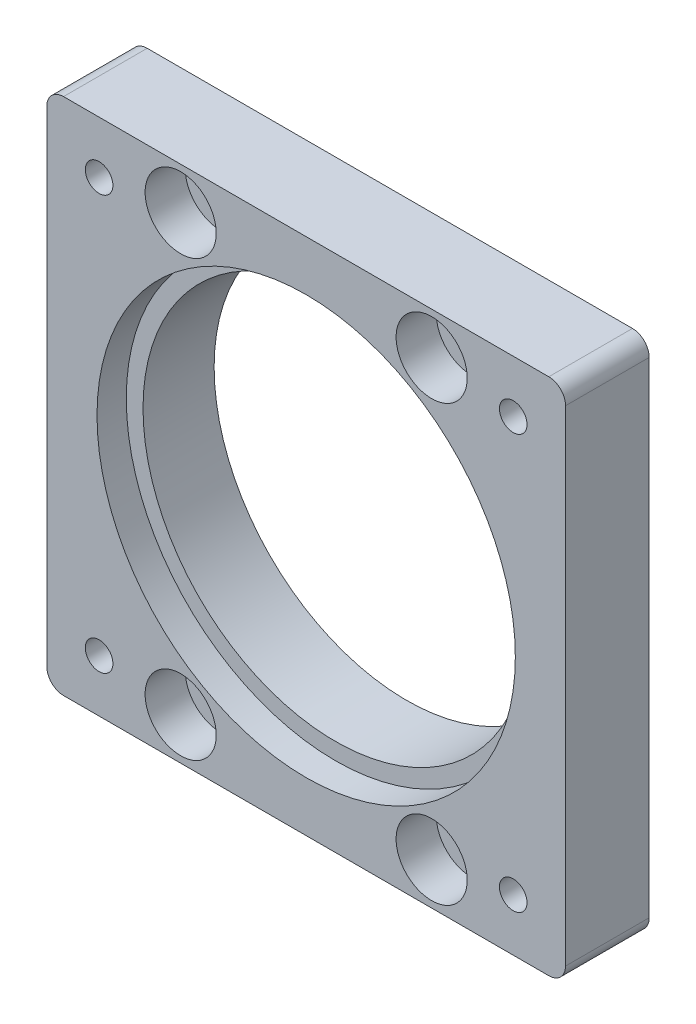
ISO-10303-21;
HEADER;
FILE_DESCRIPTION(('STEP AP214'),'2;1');
FILE_NAME('part.step','',(''),(''),'','','');
FILE_SCHEMA(('AUTOMOTIVE_DESIGN { 1 0 10303 214 1 1 1 1 }'));
ENDSEC;
DATA;
#1=APPLICATION_CONTEXT('core data for automotive mechanical design processes');
#2=APPLICATION_PROTOCOL_DEFINITION('international standard','automotive_design',2000,#1);
#3=PRODUCT_CONTEXT('',#1,'mechanical');
#4=PRODUCT('Part','Part','',(#3));
#5=PRODUCT_RELATED_PRODUCT_CATEGORY('part','',(#4));
#6=PRODUCT_DEFINITION_FORMATION('','',#4);
#7=PRODUCT_DEFINITION_CONTEXT('part definition',#1,'design');
#8=PRODUCT_DEFINITION('design','',#6,#7);
#9=PRODUCT_DEFINITION_SHAPE('','',#8);
#10=(LENGTH_UNIT() NAMED_UNIT(*) SI_UNIT(.MILLI.,.METRE.));
#11=(NAMED_UNIT(*) PLANE_ANGLE_UNIT() SI_UNIT($,.RADIAN.));
#12=(NAMED_UNIT(*) SI_UNIT($,.STERADIAN.) SOLID_ANGLE_UNIT());
#13=UNCERTAINTY_MEASURE_WITH_UNIT(LENGTH_MEASURE(1.E-05),#10,'distance_accuracy_value','');
#14=(GEOMETRIC_REPRESENTATION_CONTEXT(3) GLOBAL_UNCERTAINTY_ASSIGNED_CONTEXT((#13)) GLOBAL_UNIT_ASSIGNED_CONTEXT((#10,
#11,#12)) REPRESENTATION_CONTEXT('',''));
#15=CARTESIAN_POINT('',(0.,0.,0.));
#16=DIRECTION('',(0.,0.,1.));
#17=DIRECTION('',(1.,0.,0.));
#18=AXIS2_PLACEMENT_3D('',#15,#16,#17);
#19=CARTESIAN_POINT('',(0.,0.,10.));
#20=DIRECTION('',(0.,0.,-1.));
#21=DIRECTION('',(-1.,0.,0.));
#22=AXIS2_PLACEMENT_3D('',#19,#20,#21);
#23=PLANE('',#22);
#24=CARTESIAN_POINT('',(24.7487373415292,24.7487373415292,10.));
#25=DIRECTION('',(0.,0.,1.));
#26=DIRECTION('',(1.,0.,0.));
#27=AXIS2_PLACEMENT_3D('',#24,#25,#26);
#28=CIRCLE('',#27,1.64999999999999);
#29=CARTESIAN_POINT('',(26.3987373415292,24.7487373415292,10.));
#30=VERTEX_POINT('',#29);
#31=EDGE_CURVE('E320',#30,#30,#28,.T.);
#32=ORIENTED_EDGE('',*,*,#31,.F.);
#33=EDGE_LOOP('',(#32));
#34=FACE_BOUND('',#33,.T.);
#35=DIRECTION('',(-1.,0.,0.));
#36=VECTOR('',#35,1.);
#37=CARTESIAN_POINT('',(-31.,31.,10.));
#38=LINE('',#37,#36);
#39=CARTESIAN_POINT('',(29.,31.,10.));
#40=VERTEX_POINT('',#39);
#41=CARTESIAN_POINT('',(-29.,31.,10.));
#42=VERTEX_POINT('',#41);
#43=EDGE_CURVE('E226',#40,#42,#38,.T.);
#44=ORIENTED_EDGE('',*,*,#43,.T.);
#45=CARTESIAN_POINT('',(-29.,29.,10.));
#46=DIRECTION('',(0.,0.,-1.));
#47=DIRECTION('',(-1.,0.,0.));
#48=AXIS2_PLACEMENT_3D('',#45,#46,#47);
#49=CIRCLE('',#48,2.);
#50=CARTESIAN_POINT('',(-31.,29.,10.));
#51=VERTEX_POINT('',#50);
#52=EDGE_CURVE('E199',#42,#51,#49,.F.);
#53=ORIENTED_EDGE('',*,*,#52,.T.);
#54=DIRECTION('',(0.,-1.,0.));
#55=VECTOR('',#54,1.);
#56=CARTESIAN_POINT('',(-31.,-31.,10.));
#57=LINE('',#56,#55);
#58=CARTESIAN_POINT('',(-31.,-29.,10.));
#59=VERTEX_POINT('',#58);
#60=EDGE_CURVE('E127',#51,#59,#57,.T.);
#61=ORIENTED_EDGE('',*,*,#60,.T.);
#62=CARTESIAN_POINT('',(-29.,-29.,10.));
#63=DIRECTION('',(0.,0.,-1.));
#64=DIRECTION('',(-1.,0.,0.));
#65=AXIS2_PLACEMENT_3D('',#62,#63,#64);
#66=CIRCLE('',#65,2.);
#67=CARTESIAN_POINT('',(-29.,-31.,10.));
#68=VERTEX_POINT('',#67);
#69=EDGE_CURVE('E62',#59,#68,#66,.F.);
#70=ORIENTED_EDGE('',*,*,#69,.T.);
#71=DIRECTION('',(1.,0.,0.));
#72=VECTOR('',#71,1.);
#73=CARTESIAN_POINT('',(-31.,-31.,10.));
#74=LINE('',#73,#72);
#75=CARTESIAN_POINT('',(29.,-31.,10.));
#76=VERTEX_POINT('',#75);
#77=EDGE_CURVE('E177',#68,#76,#74,.T.);
#78=ORIENTED_EDGE('',*,*,#77,.T.);
#79=CARTESIAN_POINT('',(29.,-29.,10.));
#80=DIRECTION('',(0.,0.,-1.));
#81=DIRECTION('',(-1.,0.,0.));
#82=AXIS2_PLACEMENT_3D('',#79,#80,#81);
#83=CIRCLE('',#82,2.);
#84=CARTESIAN_POINT('',(31.,-29.,10.));
#85=VERTEX_POINT('',#84);
#86=EDGE_CURVE('E194',#76,#85,#83,.F.);
#87=ORIENTED_EDGE('',*,*,#86,.T.);
#88=DIRECTION('',(0.,1.,0.));
#89=VECTOR('',#88,1.);
#90=CARTESIAN_POINT('',(31.,-31.,10.));
#91=LINE('',#90,#89);
#92=CARTESIAN_POINT('',(31.,29.,10.));
#93=VERTEX_POINT('',#92);
#94=EDGE_CURVE('E141',#85,#93,#91,.T.);
#95=ORIENTED_EDGE('',*,*,#94,.T.);
#96=CARTESIAN_POINT('',(29.,29.,10.));
#97=DIRECTION('',(0.,0.,-1.));
#98=DIRECTION('',(-1.,0.,0.));
#99=AXIS2_PLACEMENT_3D('',#96,#97,#98);
#100=CIRCLE('',#99,2.);
#101=EDGE_CURVE('E191',#93,#40,#100,.F.);
#102=ORIENTED_EDGE('',*,*,#101,.T.);
#103=EDGE_LOOP('',(#44,#53,#61,#70,#78,#87,#95,#102));
#104=FACE_BOUND('',#103,.T.);
#105=CARTESIAN_POINT('',(0.,0.,10.));
#106=DIRECTION('',(0.,0.,1.));
#107=DIRECTION('',(1.,0.,0.));
#108=AXIS2_PLACEMENT_3D('',#105,#106,#107);
#109=CIRCLE('',#108,25.);
#110=CARTESIAN_POINT('',(25.,0.,10.));
#111=VERTEX_POINT('',#110);
#112=EDGE_CURVE('E239',#111,#111,#109,.T.);
#113=ORIENTED_EDGE('',*,*,#112,.F.);
#114=EDGE_LOOP('',(#113));
#115=FACE_BOUND('',#114,.T.);
#116=CARTESIAN_POINT('',(-15.,25.9807621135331,10.));
#117=DIRECTION('',(0.,0.,1.));
#118=DIRECTION('',(1.,0.,0.));
#119=AXIS2_PLACEMENT_3D('',#116,#117,#118);
#120=CIRCLE('',#119,4.25);
#121=CARTESIAN_POINT('',(-10.75,25.9807621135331,10.));
#122=VERTEX_POINT('',#121);
#123=EDGE_CURVE('E162',#122,#122,#120,.T.);
#124=ORIENTED_EDGE('',*,*,#123,.F.);
#125=EDGE_LOOP('',(#124));
#126=FACE_BOUND('',#125,.T.);
#127=CARTESIAN_POINT('',(15.,25.9807621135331,10.));
#128=DIRECTION('',(0.,0.,1.));
#129=DIRECTION('',(1.,0.,0.));
#130=AXIS2_PLACEMENT_3D('',#127,#128,#129);
#131=CIRCLE('',#130,4.25);
#132=CARTESIAN_POINT('',(19.25,25.9807621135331,10.));
#133=VERTEX_POINT('',#132);
#134=EDGE_CURVE('E168',#133,#133,#131,.T.);
#135=ORIENTED_EDGE('',*,*,#134,.F.);
#136=EDGE_LOOP('',(#135));
#137=FACE_BOUND('',#136,.T.);
#138=CARTESIAN_POINT('',(15.,-25.9807621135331,10.));
#139=DIRECTION('',(0.,0.,1.));
#140=DIRECTION('',(1.,0.,0.));
#141=AXIS2_PLACEMENT_3D('',#138,#139,#140);
#142=CIRCLE('',#141,4.25);
#143=CARTESIAN_POINT('',(19.25,-25.9807621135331,10.));
#144=VERTEX_POINT('',#143);
#145=EDGE_CURVE('E174',#144,#144,#142,.T.);
#146=ORIENTED_EDGE('',*,*,#145,.F.);
#147=EDGE_LOOP('',(#146));
#148=FACE_BOUND('',#147,.T.);
#149=CARTESIAN_POINT('',(-15.,-25.9807621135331,10.));
#150=DIRECTION('',(0.,0.,1.));
#151=DIRECTION('',(1.,0.,0.));
#152=AXIS2_PLACEMENT_3D('',#149,#150,#151);
#153=CIRCLE('',#152,4.25);
#154=CARTESIAN_POINT('',(-10.75,-25.9807621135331,10.));
#155=VERTEX_POINT('',#154);
#156=EDGE_CURVE('E278',#155,#155,#153,.T.);
#157=ORIENTED_EDGE('',*,*,#156,.F.);
#158=EDGE_LOOP('',(#157));
#159=FACE_BOUND('',#158,.T.);
#160=CARTESIAN_POINT('',(-24.7487373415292,-24.7487373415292,10.));
#161=DIRECTION('',(0.,0.,1.));
#162=DIRECTION('',(1.,0.,0.));
#163=AXIS2_PLACEMENT_3D('',#160,#161,#162);
#164=CIRCLE('',#163,1.64999999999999);
#165=CARTESIAN_POINT('',(-23.0987373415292,-24.7487373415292,10.));
#166=VERTEX_POINT('',#165);
#167=EDGE_CURVE('E300',#166,#166,#164,.T.);
#168=ORIENTED_EDGE('',*,*,#167,.F.);
#169=EDGE_LOOP('',(#168));
#170=FACE_BOUND('',#169,.T.);
#171=CARTESIAN_POINT('',(-24.7487373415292,24.7487373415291,10.));
#172=DIRECTION('',(0.,0.,1.));
#173=DIRECTION('',(1.,0.,0.));
#174=AXIS2_PLACEMENT_3D('',#171,#172,#173);
#175=CIRCLE('',#174,1.64999999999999);
#176=CARTESIAN_POINT('',(-23.0987373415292,24.7487373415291,10.));
#177=VERTEX_POINT('',#176);
#178=EDGE_CURVE('E308',#177,#177,#175,.T.);
#179=ORIENTED_EDGE('',*,*,#178,.F.);
#180=EDGE_LOOP('',(#179));
#181=FACE_BOUND('',#180,.T.);
#182=CARTESIAN_POINT('',(24.7487373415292,-24.7487373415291,10.));
#183=DIRECTION('',(0.,0.,1.));
#184=DIRECTION('',(1.,0.,0.));
#185=AXIS2_PLACEMENT_3D('',#182,#183,#184);
#186=CIRCLE('',#185,1.64999999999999);
#187=CARTESIAN_POINT('',(26.3987373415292,-24.7487373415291,10.));
#188=VERTEX_POINT('',#187);
#189=EDGE_CURVE('E316',#188,#188,#186,.T.);
#190=ORIENTED_EDGE('',*,*,#189,.F.);
#191=EDGE_LOOP('',(#190));
#192=FACE_BOUND('',#191,.T.);
#193=ADVANCED_FACE('F38',(#34,#104,#115,#126,#137,#148,#159,#170,#181,#192),#23,.F.);
#194=CARTESIAN_POINT('',(0.,0.,0.));
#195=DIRECTION('',(0.,0.,-1.));
#196=DIRECTION('',(-1.,0.,0.));
#197=AXIS2_PLACEMENT_3D('',#194,#195,#196);
#198=PLANE('',#197);
#199=CARTESIAN_POINT('',(24.7487373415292,24.7487373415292,0.));
#200=DIRECTION('',(0.,0.,-1.));
#201=DIRECTION('',(-1.,0.,0.));
#202=AXIS2_PLACEMENT_3D('',#199,#200,#201);
#203=CIRCLE('',#202,1.64999999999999);
#204=CARTESIAN_POINT('',(23.0987373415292,24.7487373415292,0.));
#205=VERTEX_POINT('',#204);
#206=EDGE_CURVE('E42',#205,#205,#203,.T.);
#207=ORIENTED_EDGE('',*,*,#206,.F.);
#208=EDGE_LOOP('',(#207));
#209=FACE_BOUND('',#208,.T.);
#210=CARTESIAN_POINT('',(24.7487373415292,-24.7487373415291,0.));
#211=DIRECTION('',(0.,0.,-1.));
#212=DIRECTION('',(-1.,0.,0.));
#213=AXIS2_PLACEMENT_3D('',#210,#211,#212);
#214=CIRCLE('',#213,1.64999999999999);
#215=CARTESIAN_POINT('',(23.0987373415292,-24.7487373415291,0.));
#216=VERTEX_POINT('',#215);
#217=EDGE_CURVE('E312',#216,#216,#214,.T.);
#218=ORIENTED_EDGE('',*,*,#217,.F.);
#219=EDGE_LOOP('',(#218));
#220=FACE_BOUND('',#219,.T.);
#221=CARTESIAN_POINT('',(-24.7487373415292,24.7487373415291,0.));
#222=DIRECTION('',(0.,0.,-1.));
#223=DIRECTION('',(-1.,0.,0.));
#224=AXIS2_PLACEMENT_3D('',#221,#222,#223);
#225=CIRCLE('',#224,1.64999999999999);
#226=CARTESIAN_POINT('',(-26.3987373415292,24.7487373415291,0.));
#227=VERTEX_POINT('',#226);
#228=EDGE_CURVE('E304',#227,#227,#225,.T.);
#229=ORIENTED_EDGE('',*,*,#228,.F.);
#230=EDGE_LOOP('',(#229));
#231=FACE_BOUND('',#230,.T.);
#232=CARTESIAN_POINT('',(-24.7487373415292,-24.7487373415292,0.));
#233=DIRECTION('',(0.,0.,-1.));
#234=DIRECTION('',(-1.,0.,0.));
#235=AXIS2_PLACEMENT_3D('',#232,#233,#234);
#236=CIRCLE('',#235,1.64999999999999);
#237=CARTESIAN_POINT('',(-26.3987373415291,-24.7487373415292,0.));
#238=VERTEX_POINT('',#237);
#239=EDGE_CURVE('E296',#238,#238,#236,.T.);
#240=ORIENTED_EDGE('',*,*,#239,.F.);
#241=EDGE_LOOP('',(#240));
#242=FACE_BOUND('',#241,.T.);
#243=DIRECTION('',(0.,-1.,0.));
#244=VECTOR('',#243,1.);
#245=CARTESIAN_POINT('',(-31.,-31.,0.));
#246=LINE('',#245,#244);
#247=CARTESIAN_POINT('',(-31.,29.,0.));
#248=VERTEX_POINT('',#247);
#249=CARTESIAN_POINT('',(-31.,-29.,0.));
#250=VERTEX_POINT('',#249);
#251=EDGE_CURVE('E125',#248,#250,#246,.T.);
#252=ORIENTED_EDGE('',*,*,#251,.F.);
#253=CARTESIAN_POINT('',(-29.,29.,0.));
#254=DIRECTION('',(0.,0.,-1.));
#255=DIRECTION('',(-1.,0.,0.));
#256=AXIS2_PLACEMENT_3D('',#253,#254,#255);
#257=CIRCLE('',#256,2.);
#258=CARTESIAN_POINT('',(-29.,31.,0.));
#259=VERTEX_POINT('',#258);
#260=EDGE_CURVE('E107',#248,#259,#257,.T.);
#261=ORIENTED_EDGE('',*,*,#260,.T.);
#262=DIRECTION('',(-1.,0.,0.));
#263=VECTOR('',#262,1.);
#264=CARTESIAN_POINT('',(-31.,31.,0.));
#265=LINE('',#264,#263);
#266=CARTESIAN_POINT('',(29.,31.,0.));
#267=VERTEX_POINT('',#266);
#268=EDGE_CURVE('E137',#267,#259,#265,.T.);
#269=ORIENTED_EDGE('',*,*,#268,.F.);
#270=CARTESIAN_POINT('',(29.,29.,0.));
#271=DIRECTION('',(0.,0.,-1.));
#272=DIRECTION('',(-1.,0.,0.));
#273=AXIS2_PLACEMENT_3D('',#270,#271,#272);
#274=CIRCLE('',#273,2.);
#275=CARTESIAN_POINT('',(31.,29.,0.));
#276=VERTEX_POINT('',#275);
#277=EDGE_CURVE('E129',#267,#276,#274,.T.);
#278=ORIENTED_EDGE('',*,*,#277,.T.);
#279=DIRECTION('',(0.,1.,0.));
#280=VECTOR('',#279,1.);
#281=CARTESIAN_POINT('',(31.,-31.,0.));
#282=LINE('',#281,#280);
#283=CARTESIAN_POINT('',(31.,-29.,0.));
#284=VERTEX_POINT('',#283);
#285=EDGE_CURVE('E143',#284,#276,#282,.T.);
#286=ORIENTED_EDGE('',*,*,#285,.F.);
#287=CARTESIAN_POINT('',(29.,-29.,0.));
#288=DIRECTION('',(0.,0.,-1.));
#289=DIRECTION('',(-1.,0.,0.));
#290=AXIS2_PLACEMENT_3D('',#287,#288,#289);
#291=CIRCLE('',#290,2.);
#292=CARTESIAN_POINT('',(29.,-31.,0.));
#293=VERTEX_POINT('',#292);
#294=EDGE_CURVE('E181',#284,#293,#291,.T.);
#295=ORIENTED_EDGE('',*,*,#294,.T.);
#296=DIRECTION('',(1.,0.,0.));
#297=VECTOR('',#296,1.);
#298=CARTESIAN_POINT('',(-31.,-31.,0.));
#299=LINE('',#298,#297);
#300=CARTESIAN_POINT('',(-29.,-31.,0.));
#301=VERTEX_POINT('',#300);
#302=EDGE_CURVE('E136',#301,#293,#299,.T.);
#303=ORIENTED_EDGE('',*,*,#302,.F.);
#304=CARTESIAN_POINT('',(-29.,-29.,0.));
#305=DIRECTION('',(0.,0.,-1.));
#306=DIRECTION('',(-1.,0.,0.));
#307=AXIS2_PLACEMENT_3D('',#304,#305,#306);
#308=CIRCLE('',#307,2.);
#309=EDGE_CURVE('E119',#301,#250,#308,.T.);
#310=ORIENTED_EDGE('',*,*,#309,.T.);
#311=EDGE_LOOP('',(#252,#261,#269,#278,#286,#295,#303,#310));
#312=FACE_BOUND('',#311,.T.);
#313=CARTESIAN_POINT('',(-15.,25.9807621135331,0.));
#314=DIRECTION('',(0.,0.,1.));
#315=DIRECTION('',(1.,0.,0.));
#316=AXIS2_PLACEMENT_3D('',#313,#314,#315);
#317=CIRCLE('',#316,2.25);
#318=CARTESIAN_POINT('',(-12.75,25.9807621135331,0.));
#319=VERTEX_POINT('',#318);
#320=EDGE_CURVE('E243',#319,#319,#317,.T.);
#321=ORIENTED_EDGE('',*,*,#320,.T.);
#322=EDGE_LOOP('',(#321));
#323=FACE_BOUND('',#322,.T.);
#324=CARTESIAN_POINT('',(15.,25.9807621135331,0.));
#325=DIRECTION('',(0.,0.,1.));
#326=DIRECTION('',(1.,0.,0.));
#327=AXIS2_PLACEMENT_3D('',#324,#325,#326);
#328=CIRCLE('',#327,2.25);
#329=CARTESIAN_POINT('',(17.25,25.9807621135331,0.));
#330=VERTEX_POINT('',#329);
#331=EDGE_CURVE('E250',#330,#330,#328,.T.);
#332=ORIENTED_EDGE('',*,*,#331,.T.);
#333=EDGE_LOOP('',(#332));
#334=FACE_BOUND('',#333,.T.);
#335=CARTESIAN_POINT('',(15.,-25.9807621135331,0.));
#336=DIRECTION('',(0.,0.,1.));
#337=DIRECTION('',(1.,0.,0.));
#338=AXIS2_PLACEMENT_3D('',#335,#336,#337);
#339=CIRCLE('',#338,2.25);
#340=CARTESIAN_POINT('',(17.25,-25.9807621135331,0.));
#341=VERTEX_POINT('',#340);
#342=EDGE_CURVE('E254',#341,#341,#339,.T.);
#343=ORIENTED_EDGE('',*,*,#342,.T.);
#344=EDGE_LOOP('',(#343));
#345=FACE_BOUND('',#344,.T.);
#346=CARTESIAN_POINT('',(-15.,-25.9807621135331,0.));
#347=DIRECTION('',(0.,0.,1.));
#348=DIRECTION('',(1.,0.,0.));
#349=AXIS2_PLACEMENT_3D('',#346,#347,#348);
#350=CIRCLE('',#349,2.25);
#351=CARTESIAN_POINT('',(-12.75,-25.9807621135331,0.));
#352=VERTEX_POINT('',#351);
#353=EDGE_CURVE('E156',#352,#352,#350,.T.);
#354=ORIENTED_EDGE('',*,*,#353,.T.);
#355=EDGE_LOOP('',(#354));
#356=FACE_BOUND('',#355,.T.);
#357=CARTESIAN_POINT('',(0.,0.,0.));
#358=DIRECTION('',(0.,0.,-1.));
#359=DIRECTION('',(-1.,0.,0.));
#360=AXIS2_PLACEMENT_3D('',#357,#358,#359);
#361=CIRCLE('',#360,25.);
#362=CARTESIAN_POINT('',(-25.,0.,0.));
#363=VERTEX_POINT('',#362);
#364=EDGE_CURVE('E285',#363,#363,#361,.T.);
#365=ORIENTED_EDGE('',*,*,#364,.F.);
#366=EDGE_LOOP('',(#365));
#367=FACE_BOUND('',#366,.T.);
#368=ADVANCED_FACE('F132',(#209,#220,#231,#242,#312,#323,#334,#345,#356,#367),#198,.T.);
#369=CARTESIAN_POINT('',(-15.,-25.9807621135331,0.));
#370=DIRECTION('',(0.,0.,1.));
#371=DIRECTION('',(1.,0.,0.));
#372=AXIS2_PLACEMENT_3D('',#369,#370,#371);
#373=CYLINDRICAL_SURFACE('',#372,2.25);
#374=ORIENTED_EDGE('',*,*,#353,.F.);
#375=EDGE_LOOP('',(#374));
#376=FACE_BOUND('',#375,.T.);
#377=CARTESIAN_POINT('',(-15.,-25.9807621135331,5.2));
#378=DIRECTION('',(0.,0.,1.));
#379=DIRECTION('',(1.,0.,0.));
#380=AXIS2_PLACEMENT_3D('',#377,#378,#379);
#381=CIRCLE('',#380,2.25);
#382=CARTESIAN_POINT('',(-12.75,-25.9807621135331,5.2));
#383=VERTEX_POINT('',#382);
#384=EDGE_CURVE('E170',#383,#383,#381,.F.);
#385=ORIENTED_EDGE('',*,*,#384,.F.);
#386=EDGE_LOOP('',(#385));
#387=FACE_BOUND('',#386,.T.);
#388=ADVANCED_FACE('F333',(#376,#387),#373,.F.);
#389=CARTESIAN_POINT('',(15.,-25.9807621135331,0.));
#390=DIRECTION('',(0.,0.,1.));
#391=DIRECTION('',(1.,0.,0.));
#392=AXIS2_PLACEMENT_3D('',#389,#390,#391);
#393=CYLINDRICAL_SURFACE('',#392,2.25);
#394=ORIENTED_EDGE('',*,*,#342,.F.);
#395=EDGE_LOOP('',(#394));
#396=FACE_BOUND('',#395,.T.);
#397=CARTESIAN_POINT('',(15.,-25.9807621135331,5.2));
#398=DIRECTION('',(0.,0.,1.));
#399=DIRECTION('',(1.,0.,0.));
#400=AXIS2_PLACEMENT_3D('',#397,#398,#399);
#401=CIRCLE('',#400,2.25);
#402=CARTESIAN_POINT('',(17.25,-25.9807621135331,5.2));
#403=VERTEX_POINT('',#402);
#404=EDGE_CURVE('E164',#403,#403,#401,.F.);
#405=ORIENTED_EDGE('',*,*,#404,.F.);
#406=EDGE_LOOP('',(#405));
#407=FACE_BOUND('',#406,.T.);
#408=ADVANCED_FACE('F411',(#396,#407),#393,.F.);
#409=CARTESIAN_POINT('',(15.,25.9807621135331,0.));
#410=DIRECTION('',(0.,0.,1.));
#411=DIRECTION('',(1.,0.,0.));
#412=AXIS2_PLACEMENT_3D('',#409,#410,#411);
#413=CYLINDRICAL_SURFACE('',#412,2.25);
#414=ORIENTED_EDGE('',*,*,#331,.F.);
#415=EDGE_LOOP('',(#414));
#416=FACE_BOUND('',#415,.T.);
#417=CARTESIAN_POINT('',(15.,25.9807621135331,5.2));
#418=DIRECTION('',(0.,0.,1.));
#419=DIRECTION('',(1.,0.,0.));
#420=AXIS2_PLACEMENT_3D('',#417,#418,#419);
#421=CIRCLE('',#420,2.25);
#422=CARTESIAN_POINT('',(17.25,25.9807621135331,5.2));
#423=VERTEX_POINT('',#422);
#424=EDGE_CURVE('E158',#423,#423,#421,.F.);
#425=ORIENTED_EDGE('',*,*,#424,.F.);
#426=EDGE_LOOP('',(#425));
#427=FACE_BOUND('',#426,.T.);
#428=ADVANCED_FACE('F415',(#416,#427),#413,.F.);
#429=CARTESIAN_POINT('',(-15.,25.9807621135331,0.));
#430=DIRECTION('',(0.,0.,1.));
#431=DIRECTION('',(1.,0.,0.));
#432=AXIS2_PLACEMENT_3D('',#429,#430,#431);
#433=CYLINDRICAL_SURFACE('',#432,2.25);
#434=ORIENTED_EDGE('',*,*,#320,.F.);
#435=EDGE_LOOP('',(#434));
#436=FACE_BOUND('',#435,.T.);
#437=CARTESIAN_POINT('',(-15.,25.9807621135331,5.2));
#438=DIRECTION('',(0.,0.,1.));
#439=DIRECTION('',(1.,0.,0.));
#440=AXIS2_PLACEMENT_3D('',#437,#438,#439);
#441=CIRCLE('',#440,2.25);
#442=CARTESIAN_POINT('',(-12.75,25.9807621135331,5.2));
#443=VERTEX_POINT('',#442);
#444=EDGE_CURVE('E152',#443,#443,#441,.F.);
#445=ORIENTED_EDGE('',*,*,#444,.F.);
#446=EDGE_LOOP('',(#445));
#447=FACE_BOUND('',#446,.T.);
#448=ADVANCED_FACE('F419',(#436,#447),#433,.F.);
#449=CARTESIAN_POINT('',(0.,0.,10.));
#450=DIRECTION('',(0.,0.,-1.));
#451=DIRECTION('',(-1.,0.,0.));
#452=AXIS2_PLACEMENT_3D('',#449,#450,#451);
#453=CYLINDRICAL_SURFACE('',#452,23.);
#454=CARTESIAN_POINT('',(0.,0.,6.5));
#455=DIRECTION('',(0.,0.,1.));
#456=DIRECTION('',(1.,0.,0.));
#457=AXIS2_PLACEMENT_3D('',#454,#455,#456);
#458=CIRCLE('',#457,23.);
#459=CARTESIAN_POINT('',(23.,0.,6.5));
#460=VERTEX_POINT('',#459);
#461=EDGE_CURVE('E147',#460,#460,#458,.T.);
#462=ORIENTED_EDGE('',*,*,#461,.T.);
#463=EDGE_LOOP('',(#462));
#464=FACE_BOUND('',#463,.T.);
#465=CARTESIAN_POINT('',(0.,0.,-2.));
#466=DIRECTION('',(0.,0.,-1.));
#467=DIRECTION('',(-1.,0.,0.));
#468=AXIS2_PLACEMENT_3D('',#465,#466,#467);
#469=CIRCLE('',#468,23.);
#470=CARTESIAN_POINT('',(-23.,0.,-2.));
#471=VERTEX_POINT('',#470);
#472=EDGE_CURVE('E289',#471,#471,#469,.T.);
#473=ORIENTED_EDGE('',*,*,#472,.T.);
#474=EDGE_LOOP('',(#473));
#475=FACE_BOUND('',#474,.T.);
#476=ADVANCED_FACE('F423',(#464,#475),#453,.F.);
#477=CARTESIAN_POINT('',(31.,-31.,10.));
#478=DIRECTION('',(-1.,0.,0.));
#479=DIRECTION('',(0.,0.,1.));
#480=AXIS2_PLACEMENT_3D('',#477,#478,#479);
#481=PLANE('',#480);
#482=ORIENTED_EDGE('',*,*,#94,.F.);
#483=DIRECTION('',(0.,0.,-1.));
#484=VECTOR('',#483,1.);
#485=CARTESIAN_POINT('',(31.,-29.,10.));
#486=LINE('',#485,#484);
#487=EDGE_CURVE('E11',#85,#284,#486,.T.);
#488=ORIENTED_EDGE('',*,*,#487,.T.);
#489=ORIENTED_EDGE('',*,*,#285,.T.);
#490=DIRECTION('',(0.,0.,-1.));
#491=VECTOR('',#490,1.);
#492=CARTESIAN_POINT('',(31.,29.,10.));
#493=LINE('',#492,#491);
#494=EDGE_CURVE('E48',#276,#93,#493,.F.);
#495=ORIENTED_EDGE('',*,*,#494,.T.);
#496=EDGE_LOOP('',(#482,#488,#489,#495));
#497=FACE_BOUND('',#496,.T.);
#498=ADVANCED_FACE('F216',(#497),#481,.F.);
#499=CARTESIAN_POINT('',(-31.,31.,10.));
#500=DIRECTION('',(0.,-1.,0.));
#501=DIRECTION('',(0.,0.,-1.));
#502=AXIS2_PLACEMENT_3D('',#499,#500,#501);
#503=PLANE('',#502);
#504=ORIENTED_EDGE('',*,*,#268,.T.);
#505=DIRECTION('',(0.,0.,-1.));
#506=VECTOR('',#505,1.);
#507=CARTESIAN_POINT('',(-29.,31.,10.));
#508=LINE('',#507,#506);
#509=EDGE_CURVE('E112',#259,#42,#508,.F.);
#510=ORIENTED_EDGE('',*,*,#509,.T.);
#511=ORIENTED_EDGE('',*,*,#43,.F.);
#512=DIRECTION('',(0.,0.,-1.));
#513=VECTOR('',#512,1.);
#514=CARTESIAN_POINT('',(29.,31.,10.));
#515=LINE('',#514,#513);
#516=EDGE_CURVE('E118',#40,#267,#515,.T.);
#517=ORIENTED_EDGE('',*,*,#516,.T.);
#518=EDGE_LOOP('',(#504,#510,#511,#517));
#519=FACE_BOUND('',#518,.T.);
#520=ADVANCED_FACE('F230',(#519),#503,.F.);
#521=CARTESIAN_POINT('',(-31.,-31.,10.));
#522=DIRECTION('',(1.,0.,0.));
#523=DIRECTION('',(0.,0.,-1.));
#524=AXIS2_PLACEMENT_3D('',#521,#522,#523);
#525=PLANE('',#524);
#526=ORIENTED_EDGE('',*,*,#60,.F.);
#527=DIRECTION('',(0.,0.,-1.));
#528=VECTOR('',#527,1.);
#529=CARTESIAN_POINT('',(-31.,29.,10.));
#530=LINE('',#529,#528);
#531=EDGE_CURVE('E111',#51,#248,#530,.T.);
#532=ORIENTED_EDGE('',*,*,#531,.T.);
#533=ORIENTED_EDGE('',*,*,#251,.T.);
#534=DIRECTION('',(0.,0.,-1.));
#535=VECTOR('',#534,1.);
#536=CARTESIAN_POINT('',(-31.,-29.,10.));
#537=LINE('',#536,#535);
#538=EDGE_CURVE('E130',#250,#59,#537,.F.);
#539=ORIENTED_EDGE('',*,*,#538,.T.);
#540=EDGE_LOOP('',(#526,#532,#533,#539));
#541=FACE_BOUND('',#540,.T.);
#542=ADVANCED_FACE('F124',(#541),#525,.F.);
#543=CARTESIAN_POINT('',(-31.,-31.,10.));
#544=DIRECTION('',(0.,1.,0.));
#545=DIRECTION('',(0.,0.,1.));
#546=AXIS2_PLACEMENT_3D('',#543,#544,#545);
#547=PLANE('',#546);
#548=ORIENTED_EDGE('',*,*,#77,.F.);
#549=DIRECTION('',(0.,0.,-1.));
#550=VECTOR('',#549,1.);
#551=CARTESIAN_POINT('',(-29.,-31.,10.));
#552=LINE('',#551,#550);
#553=EDGE_CURVE('E204',#68,#301,#552,.T.);
#554=ORIENTED_EDGE('',*,*,#553,.T.);
#555=ORIENTED_EDGE('',*,*,#302,.T.);
#556=DIRECTION('',(0.,0.,-1.));
#557=VECTOR('',#556,1.);
#558=CARTESIAN_POINT('',(29.,-31.,10.));
#559=LINE('',#558,#557);
#560=EDGE_CURVE('E55',#293,#76,#559,.F.);
#561=ORIENTED_EDGE('',*,*,#560,.T.);
#562=EDGE_LOOP('',(#548,#554,#555,#561));
#563=FACE_BOUND('',#562,.T.);
#564=ADVANCED_FACE('F431',(#563),#547,.F.);
#565=CARTESIAN_POINT('',(0.,0.,6.5));
#566=DIRECTION('',(0.,0.,1.));
#567=DIRECTION('',(1.,0.,0.));
#568=AXIS2_PLACEMENT_3D('',#565,#566,#567);
#569=CYLINDRICAL_SURFACE('',#568,25.);
#570=CARTESIAN_POINT('',(0.,0.,6.5));
#571=DIRECTION('',(0.,0.,1.));
#572=DIRECTION('',(1.,0.,0.));
#573=AXIS2_PLACEMENT_3D('',#570,#571,#572);
#574=CIRCLE('',#573,25.);
#575=CARTESIAN_POINT('',(25.,0.,6.5));
#576=VERTEX_POINT('',#575);
#577=EDGE_CURVE('E151',#576,#576,#574,.T.);
#578=ORIENTED_EDGE('',*,*,#577,.F.);
#579=EDGE_LOOP('',(#578));
#580=FACE_BOUND('',#579,.T.);
#581=ORIENTED_EDGE('',*,*,#112,.T.);
#582=EDGE_LOOP('',(#581));
#583=FACE_BOUND('',#582,.T.);
#584=ADVANCED_FACE('F427',(#580,#583),#569,.F.);
#585=CARTESIAN_POINT('',(0.,0.,6.5));
#586=DIRECTION('',(0.,0.,1.));
#587=DIRECTION('',(1.,0.,0.));
#588=AXIS2_PLACEMENT_3D('',#585,#586,#587);
#589=PLANE('',#588);
#590=ORIENTED_EDGE('',*,*,#461,.F.);
#591=EDGE_LOOP('',(#590));
#592=FACE_BOUND('',#591,.T.);
#593=ORIENTED_EDGE('',*,*,#577,.T.);
#594=EDGE_LOOP('',(#593));
#595=FACE_BOUND('',#594,.T.);
#596=ADVANCED_FACE('F404',(#592,#595),#589,.T.);
#597=CARTESIAN_POINT('',(-15.,25.9807621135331,5.2));
#598=DIRECTION('',(0.,0.,1.));
#599=DIRECTION('',(1.,0.,0.));
#600=AXIS2_PLACEMENT_3D('',#597,#598,#599);
#601=PLANE('',#600);
#602=CARTESIAN_POINT('',(-15.,25.9807621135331,5.2));
#603=DIRECTION('',(0.,0.,1.));
#604=DIRECTION('',(1.,0.,0.));
#605=AXIS2_PLACEMENT_3D('',#602,#603,#604);
#606=CIRCLE('',#605,4.25);
#607=CARTESIAN_POINT('',(-10.75,25.9807621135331,5.2));
#608=VERTEX_POINT('',#607);
#609=EDGE_CURVE('E157',#608,#608,#606,.T.);
#610=ORIENTED_EDGE('',*,*,#609,.T.);
#611=EDGE_LOOP('',(#610));
#612=FACE_BOUND('',#611,.T.);
#613=ORIENTED_EDGE('',*,*,#444,.T.);
#614=EDGE_LOOP('',(#613));
#615=FACE_BOUND('',#614,.T.);
#616=ADVANCED_FACE('F401',(#612,#615),#601,.T.);
#617=CARTESIAN_POINT('',(-15.,25.9807621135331,5.2));
#618=DIRECTION('',(0.,0.,1.));
#619=DIRECTION('',(1.,0.,0.));
#620=AXIS2_PLACEMENT_3D('',#617,#618,#619);
#621=CYLINDRICAL_SURFACE('',#620,4.25);
#622=ORIENTED_EDGE('',*,*,#609,.F.);
#623=EDGE_LOOP('',(#622));
#624=FACE_BOUND('',#623,.T.);
#625=ORIENTED_EDGE('',*,*,#123,.T.);
#626=EDGE_LOOP('',(#625));
#627=FACE_BOUND('',#626,.T.);
#628=ADVANCED_FACE('F396',(#624,#627),#621,.F.);
#629=CARTESIAN_POINT('',(15.,25.9807621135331,5.2));
#630=DIRECTION('',(0.,0.,1.));
#631=DIRECTION('',(1.,0.,0.));
#632=AXIS2_PLACEMENT_3D('',#629,#630,#631);
#633=PLANE('',#632);
#634=CARTESIAN_POINT('',(15.,25.9807621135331,5.2));
#635=DIRECTION('',(0.,0.,1.));
#636=DIRECTION('',(1.,0.,0.));
#637=AXIS2_PLACEMENT_3D('',#634,#635,#636);
#638=CIRCLE('',#637,4.25);
#639=CARTESIAN_POINT('',(19.25,25.9807621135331,5.2));
#640=VERTEX_POINT('',#639);
#641=EDGE_CURVE('E163',#640,#640,#638,.T.);
#642=ORIENTED_EDGE('',*,*,#641,.T.);
#643=EDGE_LOOP('',(#642));
#644=FACE_BOUND('',#643,.T.);
#645=ORIENTED_EDGE('',*,*,#424,.T.);
#646=EDGE_LOOP('',(#645));
#647=FACE_BOUND('',#646,.T.);
#648=ADVANCED_FACE('F393',(#644,#647),#633,.T.);
#649=CARTESIAN_POINT('',(15.,25.9807621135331,5.2));
#650=DIRECTION('',(0.,0.,1.));
#651=DIRECTION('',(1.,0.,0.));
#652=AXIS2_PLACEMENT_3D('',#649,#650,#651);
#653=CYLINDRICAL_SURFACE('',#652,4.25);
#654=ORIENTED_EDGE('',*,*,#641,.F.);
#655=EDGE_LOOP('',(#654));
#656=FACE_BOUND('',#655,.T.);
#657=ORIENTED_EDGE('',*,*,#134,.T.);
#658=EDGE_LOOP('',(#657));
#659=FACE_BOUND('',#658,.T.);
#660=ADVANCED_FACE('F388',(#656,#659),#653,.F.);
#661=CARTESIAN_POINT('',(15.,-25.9807621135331,5.2));
#662=DIRECTION('',(0.,0.,1.));
#663=DIRECTION('',(1.,0.,0.));
#664=AXIS2_PLACEMENT_3D('',#661,#662,#663);
#665=PLANE('',#664);
#666=CARTESIAN_POINT('',(15.,-25.9807621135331,5.2));
#667=DIRECTION('',(0.,0.,1.));
#668=DIRECTION('',(1.,0.,0.));
#669=AXIS2_PLACEMENT_3D('',#666,#667,#668);
#670=CIRCLE('',#669,4.25);
#671=CARTESIAN_POINT('',(19.25,-25.9807621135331,5.2));
#672=VERTEX_POINT('',#671);
#673=EDGE_CURVE('E169',#672,#672,#670,.T.);
#674=ORIENTED_EDGE('',*,*,#673,.T.);
#675=EDGE_LOOP('',(#674));
#676=FACE_BOUND('',#675,.T.);
#677=ORIENTED_EDGE('',*,*,#404,.T.);
#678=EDGE_LOOP('',(#677));
#679=FACE_BOUND('',#678,.T.);
#680=ADVANCED_FACE('F385',(#676,#679),#665,.T.);
#681=CARTESIAN_POINT('',(15.,-25.9807621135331,5.2));
#682=DIRECTION('',(0.,0.,1.));
#683=DIRECTION('',(1.,0.,0.));
#684=AXIS2_PLACEMENT_3D('',#681,#682,#683);
#685=CYLINDRICAL_SURFACE('',#684,4.25);
#686=ORIENTED_EDGE('',*,*,#673,.F.);
#687=EDGE_LOOP('',(#686));
#688=FACE_BOUND('',#687,.T.);
#689=ORIENTED_EDGE('',*,*,#145,.T.);
#690=EDGE_LOOP('',(#689));
#691=FACE_BOUND('',#690,.T.);
#692=ADVANCED_FACE('F380',(#688,#691),#685,.F.);
#693=CARTESIAN_POINT('',(-15.,-25.9807621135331,5.2));
#694=DIRECTION('',(0.,0.,1.));
#695=DIRECTION('',(1.,0.,0.));
#696=AXIS2_PLACEMENT_3D('',#693,#694,#695);
#697=PLANE('',#696);
#698=CARTESIAN_POINT('',(-15.,-25.9807621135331,5.2));
#699=DIRECTION('',(0.,0.,1.));
#700=DIRECTION('',(1.,0.,0.));
#701=AXIS2_PLACEMENT_3D('',#698,#699,#700);
#702=CIRCLE('',#701,4.25);
#703=CARTESIAN_POINT('',(-10.75,-25.9807621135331,5.2));
#704=VERTEX_POINT('',#703);
#705=EDGE_CURVE('E175',#704,#704,#702,.T.);
#706=ORIENTED_EDGE('',*,*,#705,.T.);
#707=EDGE_LOOP('',(#706));
#708=FACE_BOUND('',#707,.T.);
#709=ORIENTED_EDGE('',*,*,#384,.T.);
#710=EDGE_LOOP('',(#709));
#711=FACE_BOUND('',#710,.T.);
#712=ADVANCED_FACE('F376',(#708,#711),#697,.T.);
#713=CARTESIAN_POINT('',(-15.,-25.9807621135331,5.2));
#714=DIRECTION('',(0.,0.,1.));
#715=DIRECTION('',(1.,0.,0.));
#716=AXIS2_PLACEMENT_3D('',#713,#714,#715);
#717=CYLINDRICAL_SURFACE('',#716,4.25);
#718=ORIENTED_EDGE('',*,*,#705,.F.);
#719=EDGE_LOOP('',(#718));
#720=FACE_BOUND('',#719,.T.);
#721=ORIENTED_EDGE('',*,*,#156,.T.);
#722=EDGE_LOOP('',(#721));
#723=FACE_BOUND('',#722,.T.);
#724=ADVANCED_FACE('F379',(#720,#723),#717,.F.);
#725=CARTESIAN_POINT('',(-29.,29.,10.));
#726=DIRECTION('',(0.,0.,-1.));
#727=DIRECTION('',(-1.,0.,0.));
#728=AXIS2_PLACEMENT_3D('',#725,#726,#727);
#729=CYLINDRICAL_SURFACE('',#728,2.);
#730=ORIENTED_EDGE('',*,*,#52,.F.);
#731=ORIENTED_EDGE('',*,*,#509,.F.);
#732=ORIENTED_EDGE('',*,*,#260,.F.);
#733=ORIENTED_EDGE('',*,*,#531,.F.);
#734=EDGE_LOOP('',(#730,#731,#732,#733));
#735=FACE_BOUND('',#734,.T.);
#736=ADVANCED_FACE('F110',(#735),#729,.T.);
#737=CARTESIAN_POINT('',(-29.,-29.,10.));
#738=DIRECTION('',(0.,0.,-1.));
#739=DIRECTION('',(-1.,0.,0.));
#740=AXIS2_PLACEMENT_3D('',#737,#738,#739);
#741=CYLINDRICAL_SURFACE('',#740,2.);
#742=ORIENTED_EDGE('',*,*,#69,.F.);
#743=ORIENTED_EDGE('',*,*,#538,.F.);
#744=ORIENTED_EDGE('',*,*,#309,.F.);
#745=ORIENTED_EDGE('',*,*,#553,.F.);
#746=EDGE_LOOP('',(#742,#743,#744,#745));
#747=FACE_BOUND('',#746,.T.);
#748=ADVANCED_FACE('F446',(#747),#741,.T.);
#749=CARTESIAN_POINT('',(29.,-29.,10.));
#750=DIRECTION('',(0.,0.,-1.));
#751=DIRECTION('',(-1.,0.,0.));
#752=AXIS2_PLACEMENT_3D('',#749,#750,#751);
#753=CYLINDRICAL_SURFACE('',#752,2.);
#754=ORIENTED_EDGE('',*,*,#86,.F.);
#755=ORIENTED_EDGE('',*,*,#560,.F.);
#756=ORIENTED_EDGE('',*,*,#294,.F.);
#757=ORIENTED_EDGE('',*,*,#487,.F.);
#758=EDGE_LOOP('',(#754,#755,#756,#757));
#759=FACE_BOUND('',#758,.T.);
#760=ADVANCED_FACE('F448',(#759),#753,.T.);
#761=CARTESIAN_POINT('',(29.,29.,10.));
#762=DIRECTION('',(0.,0.,-1.));
#763=DIRECTION('',(-1.,0.,0.));
#764=AXIS2_PLACEMENT_3D('',#761,#762,#763);
#765=CYLINDRICAL_SURFACE('',#764,2.);
#766=ORIENTED_EDGE('',*,*,#101,.F.);
#767=ORIENTED_EDGE('',*,*,#494,.F.);
#768=ORIENTED_EDGE('',*,*,#277,.F.);
#769=ORIENTED_EDGE('',*,*,#516,.F.);
#770=EDGE_LOOP('',(#766,#767,#768,#769));
#771=FACE_BOUND('',#770,.T.);
#772=ADVANCED_FACE('F40',(#771),#765,.T.);
#773=CARTESIAN_POINT('',(0.,0.,-2.));
#774=DIRECTION('',(0.,0.,-1.));
#775=DIRECTION('',(-1.,0.,0.));
#776=AXIS2_PLACEMENT_3D('',#773,#774,#775);
#777=PLANE('',#776);
#778=CARTESIAN_POINT('',(0.,0.,-2.));
#779=DIRECTION('',(0.,0.,-1.));
#780=DIRECTION('',(-1.,0.,0.));
#781=AXIS2_PLACEMENT_3D('',#778,#779,#780);
#782=CIRCLE('',#781,25.);
#783=CARTESIAN_POINT('',(-25.,0.,-2.));
#784=VERTEX_POINT('',#783);
#785=EDGE_CURVE('E281',#784,#784,#782,.T.);
#786=ORIENTED_EDGE('',*,*,#785,.T.);
#787=EDGE_LOOP('',(#786));
#788=FACE_BOUND('',#787,.T.);
#789=ORIENTED_EDGE('',*,*,#472,.F.);
#790=EDGE_LOOP('',(#789));
#791=FACE_BOUND('',#790,.T.);
#792=ADVANCED_FACE('F369',(#788,#791),#777,.T.);
#793=CARTESIAN_POINT('',(0.,0.,-2.));
#794=DIRECTION('',(0.,0.,1.));
#795=DIRECTION('',(1.,0.,0.));
#796=AXIS2_PLACEMENT_3D('',#793,#794,#795);
#797=CYLINDRICAL_SURFACE('',#796,25.);
#798=ORIENTED_EDGE('',*,*,#785,.F.);
#799=EDGE_LOOP('',(#798));
#800=FACE_BOUND('',#799,.T.);
#801=ORIENTED_EDGE('',*,*,#364,.T.);
#802=EDGE_LOOP('',(#801));
#803=FACE_BOUND('',#802,.T.);
#804=ADVANCED_FACE('F345',(#800,#803),#797,.T.);
#805=CARTESIAN_POINT('',(-24.7487373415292,-24.7487373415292,10.));
#806=DIRECTION('',(0.,0.,1.));
#807=DIRECTION('',(1.,0.,0.));
#808=AXIS2_PLACEMENT_3D('',#805,#806,#807);
#809=CYLINDRICAL_SURFACE('',#808,1.64999999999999);
#810=ORIENTED_EDGE('',*,*,#239,.T.);
#811=EDGE_LOOP('',(#810));
#812=FACE_BOUND('',#811,.T.);
#813=ORIENTED_EDGE('',*,*,#167,.T.);
#814=EDGE_LOOP('',(#813));
#815=FACE_BOUND('',#814,.T.);
#816=ADVANCED_FACE('F341',(#812,#815),#809,.F.);
#817=CARTESIAN_POINT('',(-24.7487373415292,24.7487373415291,10.));
#818=DIRECTION('',(0.,0.,1.));
#819=DIRECTION('',(1.,0.,0.));
#820=AXIS2_PLACEMENT_3D('',#817,#818,#819);
#821=CYLINDRICAL_SURFACE('',#820,1.64999999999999);
#822=ORIENTED_EDGE('',*,*,#228,.T.);
#823=EDGE_LOOP('',(#822));
#824=FACE_BOUND('',#823,.T.);
#825=ORIENTED_EDGE('',*,*,#178,.T.);
#826=EDGE_LOOP('',(#825));
#827=FACE_BOUND('',#826,.T.);
#828=ADVANCED_FACE('F344',(#824,#827),#821,.F.);
#829=CARTESIAN_POINT('',(24.7487373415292,-24.7487373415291,10.));
#830=DIRECTION('',(0.,0.,1.));
#831=DIRECTION('',(1.,0.,0.));
#832=AXIS2_PLACEMENT_3D('',#829,#830,#831);
#833=CYLINDRICAL_SURFACE('',#832,1.64999999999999);
#834=ORIENTED_EDGE('',*,*,#217,.T.);
#835=EDGE_LOOP('',(#834));
#836=FACE_BOUND('',#835,.T.);
#837=ORIENTED_EDGE('',*,*,#189,.T.);
#838=EDGE_LOOP('',(#837));
#839=FACE_BOUND('',#838,.T.);
#840=ADVANCED_FACE('F357',(#836,#839),#833,.F.);
#841=CARTESIAN_POINT('',(24.7487373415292,24.7487373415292,10.));
#842=DIRECTION('',(0.,0.,1.));
#843=DIRECTION('',(1.,0.,0.));
#844=AXIS2_PLACEMENT_3D('',#841,#842,#843);
#845=CYLINDRICAL_SURFACE('',#844,1.64999999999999);
#846=ORIENTED_EDGE('',*,*,#206,.T.);
#847=EDGE_LOOP('',(#846));
#848=FACE_BOUND('',#847,.T.);
#849=ORIENTED_EDGE('',*,*,#31,.T.);
#850=EDGE_LOOP('',(#849));
#851=FACE_BOUND('',#850,.T.);
#852=ADVANCED_FACE('F329',(#848,#851),#845,.F.);
#853=CLOSED_SHELL('',(#193,#368,#388,#408,#428,#448,#476,#498,#520,#542,#564,#584,#596,#616,
#628,#648,#660,#680,#692,#712,#724,#736,#748,#760,#772,#792,#804,#816,#828,#840,#852));
#854=MANIFOLD_SOLID_BREP('B2',#853);
#855=ADVANCED_BREP_SHAPE_REPRESENTATION('',(#18,#854),#14);
#856=SHAPE_DEFINITION_REPRESENTATION(#9,#855);
ENDSEC;
END-ISO-10303-21;
